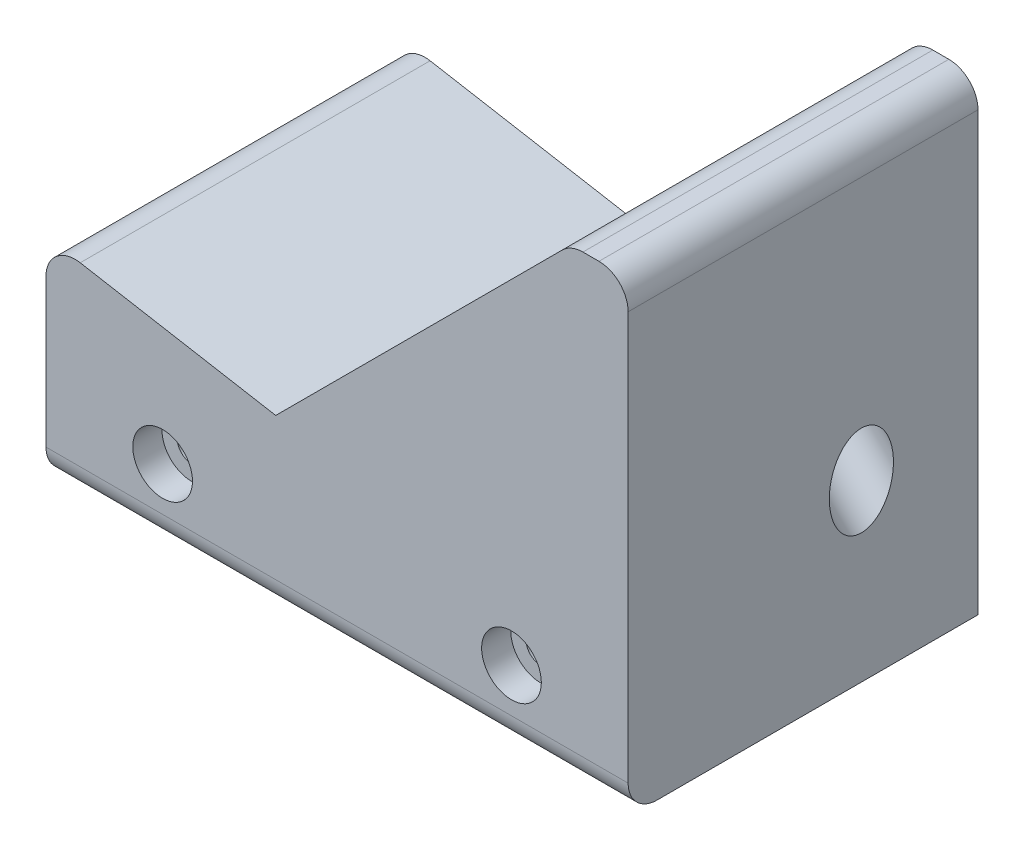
ISO-10303-21;
HEADER;
FILE_DESCRIPTION(('STEP AP214'),'2;1');
FILE_NAME('part.step','',(''),(''),'','','');
FILE_SCHEMA(('AUTOMOTIVE_DESIGN { 1 0 10303 214 1 1 1 1 }'));
ENDSEC;
DATA;
#1=APPLICATION_CONTEXT('core data for automotive mechanical design processes');
#2=APPLICATION_PROTOCOL_DEFINITION('international standard','automotive_design',2000,#1);
#3=PRODUCT_CONTEXT('',#1,'mechanical');
#4=PRODUCT('Part','Part','',(#3));
#5=PRODUCT_RELATED_PRODUCT_CATEGORY('part','',(#4));
#6=PRODUCT_DEFINITION_FORMATION('','',#4);
#7=PRODUCT_DEFINITION_CONTEXT('part definition',#1,'design');
#8=PRODUCT_DEFINITION('design','',#6,#7);
#9=PRODUCT_DEFINITION_SHAPE('','',#8);
#10=(LENGTH_UNIT() NAMED_UNIT(*) SI_UNIT(.MILLI.,.METRE.));
#11=(NAMED_UNIT(*) PLANE_ANGLE_UNIT() SI_UNIT($,.RADIAN.));
#12=(NAMED_UNIT(*) SI_UNIT($,.STERADIAN.) SOLID_ANGLE_UNIT());
#13=UNCERTAINTY_MEASURE_WITH_UNIT(LENGTH_MEASURE(1.E-05),#10,'distance_accuracy_value','');
#14=(GEOMETRIC_REPRESENTATION_CONTEXT(3) GLOBAL_UNCERTAINTY_ASSIGNED_CONTEXT((#13)) GLOBAL_UNIT_ASSIGNED_CONTEXT((#10,
#11,#12)) REPRESENTATION_CONTEXT('',''));
#15=CARTESIAN_POINT('',(0.,0.,0.));
#16=DIRECTION('',(0.,0.,1.));
#17=DIRECTION('',(1.,0.,0.));
#18=AXIS2_PLACEMENT_3D('',#15,#16,#17);
#19=CARTESIAN_POINT('',(37.874359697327,1171.575,-63.5));
#20=DIRECTION('',(0.,0.,1.));
#21=DIRECTION('',(1.,0.,0.));
#22=AXIS2_PLACEMENT_3D('',#19,#20,#21);
#23=CYLINDRICAL_SURFACE('',#22,3.17500000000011);
#24=CARTESIAN_POINT('',(37.874359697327,1171.575,-63.5));
#25=DIRECTION('',(0.,0.,1.));
#26=DIRECTION('',(1.,0.,0.));
#27=AXIS2_PLACEMENT_3D('',#24,#25,#26);
#28=CIRCLE('',#27,3.17500000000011);
#29=CARTESIAN_POINT('',(41.0493596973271,1171.575,-63.5));
#30=VERTEX_POINT('',#29);
#31=EDGE_CURVE('E176',#30,#30,#28,.T.);
#32=CARTESIAN_POINT('',(37.874359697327,1171.575,6.34999999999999));
#33=DIRECTION('',(0.,0.,1.));
#34=DIRECTION('',(1.,0.,0.));
#35=AXIS2_PLACEMENT_3D('',#32,#33,#34);
#36=CIRCLE('',#35,3.17500000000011);
#37=CARTESIAN_POINT('',(41.0493596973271,1171.575,6.34999999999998));
#38=VERTEX_POINT('',#37);
#39=EDGE_CURVE('E44',#38,#38,#36,.F.);
#40=CARTESIAN_POINT('',(41.0493596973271,1171.575,-63.5));
#41=CARTESIAN_POINT('',(41.0493596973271,1171.575,-62.7723958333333));
#42=CARTESIAN_POINT('',(41.0493596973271,1171.575,-62.0447916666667));
#43=CARTESIAN_POINT('',(41.0493596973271,1171.575,-60.5895833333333));
#44=CARTESIAN_POINT('',(41.0493596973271,1171.575,-59.8619791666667));
#45=CARTESIAN_POINT('',(41.0493596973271,1171.575,-58.4067708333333));
#46=CARTESIAN_POINT('',(41.0493596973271,1171.575,-57.6791666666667));
#47=CARTESIAN_POINT('',(41.0493596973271,1171.575,-56.2239583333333));
#48=CARTESIAN_POINT('',(41.0493596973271,1171.575,-55.4963541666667));
#49=CARTESIAN_POINT('',(41.0493596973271,1171.575,-54.0411458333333));
#50=CARTESIAN_POINT('',(41.0493596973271,1171.575,-53.3135416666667));
#51=CARTESIAN_POINT('',(41.0493596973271,1171.575,-51.8583333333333));
#52=CARTESIAN_POINT('',(41.0493596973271,1171.575,-51.1307291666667));
#53=CARTESIAN_POINT('',(41.0493596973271,1171.575,-49.6755208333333));
#54=CARTESIAN_POINT('',(41.0493596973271,1171.575,-48.9479166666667));
#55=CARTESIAN_POINT('',(41.0493596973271,1171.575,-47.4927083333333));
#56=CARTESIAN_POINT('',(41.0493596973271,1171.575,-46.7651041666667));
#57=CARTESIAN_POINT('',(41.0493596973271,1171.575,-45.3098958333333));
#58=CARTESIAN_POINT('',(41.0493596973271,1171.575,-44.5822916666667));
#59=CARTESIAN_POINT('',(41.0493596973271,1171.575,-43.1270833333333));
#60=CARTESIAN_POINT('',(41.0493596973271,1171.575,-42.3994791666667));
#61=CARTESIAN_POINT('',(41.0493596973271,1171.575,-40.9442708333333));
#62=CARTESIAN_POINT('',(41.0493596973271,1171.575,-40.2166666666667));
#63=CARTESIAN_POINT('',(41.0493596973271,1171.575,-38.7614583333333));
#64=CARTESIAN_POINT('',(41.0493596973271,1171.575,-38.0338541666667));
#65=CARTESIAN_POINT('',(41.0493596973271,1171.575,-36.5786458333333));
#66=CARTESIAN_POINT('',(41.0493596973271,1171.575,-35.8510416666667));
#67=CARTESIAN_POINT('',(41.0493596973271,1171.575,-34.3958333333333));
#68=CARTESIAN_POINT('',(41.0493596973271,1171.575,-33.6682291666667));
#69=CARTESIAN_POINT('',(41.0493596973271,1171.575,-32.2130208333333));
#70=CARTESIAN_POINT('',(41.0493596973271,1171.575,-31.4854166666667));
#71=CARTESIAN_POINT('',(41.0493596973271,1171.575,-30.0302083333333));
#72=CARTESIAN_POINT('',(41.0493596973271,1171.575,-29.3026041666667));
#73=CARTESIAN_POINT('',(41.0493596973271,1171.575,-27.8473958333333));
#74=CARTESIAN_POINT('',(41.0493596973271,1171.575,-27.1197916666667));
#75=CARTESIAN_POINT('',(41.0493596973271,1171.575,-25.6645833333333));
#76=CARTESIAN_POINT('',(41.0493596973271,1171.575,-24.9369791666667));
#77=CARTESIAN_POINT('',(41.0493596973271,1171.575,-23.4817708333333));
#78=CARTESIAN_POINT('',(41.0493596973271,1171.575,-22.7541666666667));
#79=CARTESIAN_POINT('',(41.0493596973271,1171.575,-21.2989583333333));
#80=CARTESIAN_POINT('',(41.0493596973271,1171.575,-20.5713541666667));
#81=CARTESIAN_POINT('',(41.0493596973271,1171.575,-19.1161458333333));
#82=CARTESIAN_POINT('',(41.0493596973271,1171.575,-18.3885416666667));
#83=CARTESIAN_POINT('',(41.0493596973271,1171.575,-16.9333333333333));
#84=CARTESIAN_POINT('',(41.0493596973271,1171.575,-16.2057291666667));
#85=CARTESIAN_POINT('',(41.0493596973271,1171.575,-14.7505208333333));
#86=CARTESIAN_POINT('',(41.0493596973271,1171.575,-14.0229166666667));
#87=CARTESIAN_POINT('',(41.0493596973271,1171.575,-12.5677083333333));
#88=CARTESIAN_POINT('',(41.0493596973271,1171.575,-11.8401041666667));
#89=CARTESIAN_POINT('',(41.0493596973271,1171.575,-10.3848958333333));
#90=CARTESIAN_POINT('',(41.0493596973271,1171.575,-9.65729166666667));
#91=CARTESIAN_POINT('',(41.0493596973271,1171.575,-8.20208333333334));
#92=CARTESIAN_POINT('',(41.0493596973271,1171.575,-7.47447916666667));
#93=CARTESIAN_POINT('',(41.0493596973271,1171.575,-6.01927083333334));
#94=CARTESIAN_POINT('',(41.0493596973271,1171.575,-5.29166666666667));
#95=CARTESIAN_POINT('',(41.0493596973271,1171.575,-3.83645833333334));
#96=CARTESIAN_POINT('',(41.0493596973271,1171.575,-3.10885416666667));
#97=CARTESIAN_POINT('',(41.0493596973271,1171.575,-1.65364583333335));
#98=CARTESIAN_POINT('',(41.0493596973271,1171.575,-0.926041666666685));
#99=CARTESIAN_POINT('',(41.0493596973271,1171.575,0.529166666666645));
#100=CARTESIAN_POINT('',(41.0493596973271,1171.575,1.25677083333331));
#101=CARTESIAN_POINT('',(41.0493596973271,1171.575,2.71197916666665));
#102=CARTESIAN_POINT('',(41.0493596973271,1171.575,3.43958333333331));
#103=CARTESIAN_POINT('',(41.0493596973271,1171.575,4.89479166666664));
#104=CARTESIAN_POINT('',(41.0493596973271,1171.575,5.62239583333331));
#105=CARTESIAN_POINT('',(41.0493596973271,1171.575,6.34999999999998));
#106=B_SPLINE_CURVE_WITH_KNOTS('',3,(#40,#41,#42,#43,#44,#45,#46,#47,#48,#49,#50,#51,#52,#53,
#54,#55,#56,#57,#58,#59,#60,#61,#62,#63,#64,#65,#66,#67,#68,#69,#70,#71,#72,#73,#74,#75,#76,#77,
#78,#79,#80,#81,#82,#83,#84,#85,#86,#87,#88,#89,#90,#91,#92,#93,#94,#95,#96,#97,#98,#99,#100,
#101,#102,#103,#104,#105),.UNSPECIFIED.,.F.,.F.,(4,2,2,2,2,2,2,2,2,2,2,2,2,2,2,2,2,2,2,2,2,2,2,
2,2,2,2,2,2,2,2,2,4),(0.,2.18281250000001,4.365625,6.5484375,8.73125000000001,10.9140625,
13.096875,15.2796875,17.4625,19.6453125,21.828125,24.0109375,26.19375,28.3765625,30.559375,
32.7421875,34.925,37.1078125,39.290625,41.4734375,43.65625,45.8390625,48.021875,50.2046875,
52.3875,54.5703125,56.753125,58.9359375,61.11875,63.3015625,65.484375,67.6671875,69.85),.UNSPECIFIED.);
#107=EDGE_CURVE('BSEAM40',#30,#38,#106,.T.);
#108=ORIENTED_EDGE('',*,*,#31,.F.);
#109=ORIENTED_EDGE('',*,*,#39,.F.);
#110=ORIENTED_EDGE('',*,*,#107,.T.);
#111=ORIENTED_EDGE('',*,*,#107,.F.);
#112=EDGE_LOOP('',(#108,#110,#109,#111));
#113=FACE_BOUND('',#112,.T.);
#114=ADVANCED_FACE('F40',(#113),#23,.F.);
#115=CARTESIAN_POINT('',(-38.1000000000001,1171.575,-63.5));
#116=DIRECTION('',(0.,0.,1.));
#117=DIRECTION('',(1.,0.,0.));
#118=AXIS2_PLACEMENT_3D('',#115,#116,#117);
#119=CYLINDRICAL_SURFACE('',#118,3.17500000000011);
#120=CARTESIAN_POINT('',(-38.1000000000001,1171.575,-63.5));
#121=DIRECTION('',(0.,0.,1.));
#122=DIRECTION('',(1.,0.,0.));
#123=AXIS2_PLACEMENT_3D('',#120,#121,#122);
#124=CIRCLE('',#123,3.17500000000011);
#125=CARTESIAN_POINT('',(-34.9249999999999,1171.575,-63.5));
#126=VERTEX_POINT('',#125);
#127=EDGE_CURVE('E128',#126,#126,#124,.T.);
#128=CARTESIAN_POINT('',(-38.1000000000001,1171.575,6.34999999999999));
#129=DIRECTION('',(0.,0.,1.));
#130=DIRECTION('',(1.,0.,0.));
#131=AXIS2_PLACEMENT_3D('',#128,#129,#130);
#132=CIRCLE('',#131,3.17500000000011);
#133=CARTESIAN_POINT('',(-34.9249999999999,1171.575,6.34999999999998));
#134=VERTEX_POINT('',#133);
#135=EDGE_CURVE('E170',#134,#134,#132,.F.);
#136=CARTESIAN_POINT('',(-34.9249999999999,1171.575,-63.5));
#137=CARTESIAN_POINT('',(-34.9249999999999,1171.575,-62.7723958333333));
#138=CARTESIAN_POINT('',(-34.9249999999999,1171.575,-62.0447916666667));
#139=CARTESIAN_POINT('',(-34.9249999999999,1171.575,-60.5895833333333));
#140=CARTESIAN_POINT('',(-34.9249999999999,1171.575,-59.8619791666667));
#141=CARTESIAN_POINT('',(-34.9249999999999,1171.575,-58.4067708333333));
#142=CARTESIAN_POINT('',(-34.9249999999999,1171.575,-57.6791666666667));
#143=CARTESIAN_POINT('',(-34.9249999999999,1171.575,-56.2239583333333));
#144=CARTESIAN_POINT('',(-34.9249999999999,1171.575,-55.4963541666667));
#145=CARTESIAN_POINT('',(-34.9249999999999,1171.575,-54.0411458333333));
#146=CARTESIAN_POINT('',(-34.9249999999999,1171.575,-53.3135416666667));
#147=CARTESIAN_POINT('',(-34.9249999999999,1171.575,-51.8583333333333));
#148=CARTESIAN_POINT('',(-34.9249999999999,1171.575,-51.1307291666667));
#149=CARTESIAN_POINT('',(-34.9249999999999,1171.575,-49.6755208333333));
#150=CARTESIAN_POINT('',(-34.9249999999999,1171.575,-48.9479166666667));
#151=CARTESIAN_POINT('',(-34.9249999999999,1171.575,-47.4927083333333));
#152=CARTESIAN_POINT('',(-34.9249999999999,1171.575,-46.7651041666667));
#153=CARTESIAN_POINT('',(-34.9249999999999,1171.575,-45.3098958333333));
#154=CARTESIAN_POINT('',(-34.9249999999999,1171.575,-44.5822916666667));
#155=CARTESIAN_POINT('',(-34.9249999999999,1171.575,-43.1270833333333));
#156=CARTESIAN_POINT('',(-34.9249999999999,1171.575,-42.3994791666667));
#157=CARTESIAN_POINT('',(-34.9249999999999,1171.575,-40.9442708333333));
#158=CARTESIAN_POINT('',(-34.9249999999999,1171.575,-40.2166666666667));
#159=CARTESIAN_POINT('',(-34.9249999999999,1171.575,-38.7614583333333));
#160=CARTESIAN_POINT('',(-34.9249999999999,1171.575,-38.0338541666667));
#161=CARTESIAN_POINT('',(-34.9249999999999,1171.575,-36.5786458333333));
#162=CARTESIAN_POINT('',(-34.9249999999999,1171.575,-35.8510416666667));
#163=CARTESIAN_POINT('',(-34.9249999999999,1171.575,-34.3958333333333));
#164=CARTESIAN_POINT('',(-34.9249999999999,1171.575,-33.6682291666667));
#165=CARTESIAN_POINT('',(-34.9249999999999,1171.575,-32.2130208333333));
#166=CARTESIAN_POINT('',(-34.9249999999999,1171.575,-31.4854166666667));
#167=CARTESIAN_POINT('',(-34.9249999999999,1171.575,-30.0302083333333));
#168=CARTESIAN_POINT('',(-34.9249999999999,1171.575,-29.3026041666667));
#169=CARTESIAN_POINT('',(-34.9249999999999,1171.575,-27.8473958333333));
#170=CARTESIAN_POINT('',(-34.9249999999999,1171.575,-27.1197916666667));
#171=CARTESIAN_POINT('',(-34.9249999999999,1171.575,-25.6645833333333));
#172=CARTESIAN_POINT('',(-34.9249999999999,1171.575,-24.9369791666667));
#173=CARTESIAN_POINT('',(-34.9249999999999,1171.575,-23.4817708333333));
#174=CARTESIAN_POINT('',(-34.9249999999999,1171.575,-22.7541666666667));
#175=CARTESIAN_POINT('',(-34.9249999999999,1171.575,-21.2989583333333));
#176=CARTESIAN_POINT('',(-34.9249999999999,1171.575,-20.5713541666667));
#177=CARTESIAN_POINT('',(-34.9249999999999,1171.575,-19.1161458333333));
#178=CARTESIAN_POINT('',(-34.9249999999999,1171.575,-18.3885416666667));
#179=CARTESIAN_POINT('',(-34.9249999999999,1171.575,-16.9333333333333));
#180=CARTESIAN_POINT('',(-34.9249999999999,1171.575,-16.2057291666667));
#181=CARTESIAN_POINT('',(-34.9249999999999,1171.575,-14.7505208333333));
#182=CARTESIAN_POINT('',(-34.9249999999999,1171.575,-14.0229166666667));
#183=CARTESIAN_POINT('',(-34.9249999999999,1171.575,-12.5677083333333));
#184=CARTESIAN_POINT('',(-34.9249999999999,1171.575,-11.8401041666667));
#185=CARTESIAN_POINT('',(-34.9249999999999,1171.575,-10.3848958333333));
#186=CARTESIAN_POINT('',(-34.9249999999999,1171.575,-9.65729166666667));
#187=CARTESIAN_POINT('',(-34.9249999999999,1171.575,-8.20208333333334));
#188=CARTESIAN_POINT('',(-34.9249999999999,1171.575,-7.47447916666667));
#189=CARTESIAN_POINT('',(-34.9249999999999,1171.575,-6.01927083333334));
#190=CARTESIAN_POINT('',(-34.9249999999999,1171.575,-5.29166666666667));
#191=CARTESIAN_POINT('',(-34.9249999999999,1171.575,-3.83645833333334));
#192=CARTESIAN_POINT('',(-34.9249999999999,1171.575,-3.10885416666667));
#193=CARTESIAN_POINT('',(-34.9249999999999,1171.575,-1.65364583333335));
#194=CARTESIAN_POINT('',(-34.9249999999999,1171.575,-0.926041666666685));
#195=CARTESIAN_POINT('',(-34.9249999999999,1171.575,0.529166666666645));
#196=CARTESIAN_POINT('',(-34.9249999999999,1171.575,1.25677083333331));
#197=CARTESIAN_POINT('',(-34.9249999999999,1171.575,2.71197916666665));
#198=CARTESIAN_POINT('',(-34.9249999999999,1171.575,3.43958333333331));
#199=CARTESIAN_POINT('',(-34.9249999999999,1171.575,4.89479166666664));
#200=CARTESIAN_POINT('',(-34.9249999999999,1171.575,5.62239583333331));
#201=CARTESIAN_POINT('',(-34.9249999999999,1171.575,6.34999999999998));
#202=B_SPLINE_CURVE_WITH_KNOTS('',3,(#136,#137,#138,#139,#140,#141,#142,#143,#144,#145,#146,
#147,#148,#149,#150,#151,#152,#153,#154,#155,#156,#157,#158,#159,#160,#161,#162,#163,#164,#165,
#166,#167,#168,#169,#170,#171,#172,#173,#174,#175,#176,#177,#178,#179,#180,#181,#182,#183,#184,
#185,#186,#187,#188,#189,#190,#191,#192,#193,#194,#195,#196,#197,#198,#199,#200,#201),
.UNSPECIFIED.,.F.,.F.,(4,2,2,2,2,2,2,2,2,2,2,2,2,2,2,2,2,2,2,2,2,2,2,2,2,2,2,2,2,2,2,2,4),(0.,
2.18281250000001,4.365625,6.5484375,8.73125000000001,10.9140625,13.096875,15.2796875,17.4625,
19.6453125,21.828125,24.0109375,26.19375,28.3765625,30.559375,32.7421875,34.925,37.1078125,
39.290625,41.4734375,43.65625,45.8390625,48.021875,50.2046875,52.3875,54.5703125,56.753125,
58.9359375,61.11875,63.3015625,65.484375,67.6671875,69.85),.UNSPECIFIED.);
#203=EDGE_CURVE('BSEAM266',#126,#134,#202,.T.);
#204=ORIENTED_EDGE('',*,*,#127,.F.);
#205=ORIENTED_EDGE('',*,*,#135,.F.);
#206=ORIENTED_EDGE('',*,*,#203,.T.);
#207=ORIENTED_EDGE('',*,*,#203,.F.);
#208=EDGE_LOOP('',(#204,#206,#205,#207));
#209=FACE_BOUND('',#208,.T.);
#210=ADVANCED_FACE('F266',(#209),#119,.F.);
#211=CARTESIAN_POINT('',(-63.5,1155.7,12.7));
#212=DIRECTION('',(-1.,0.,0.));
#213=DIRECTION('',(0.,-1.,0.));
#214=AXIS2_PLACEMENT_3D('',#211,#212,#213);
#215=PLANE('',#214);
#216=DIRECTION('',(0.,0.,-1.));
#217=VECTOR('',#216,1.);
#218=CARTESIAN_POINT('',(-63.5000000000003,1194.28192596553,12.7));
#219=LINE('',#218,#217);
#220=CARTESIAN_POINT('',(-63.5000000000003,1194.28192596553,12.7));
#221=VERTEX_POINT('',#220);
#222=CARTESIAN_POINT('',(-63.5000000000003,1194.28192596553,-63.5));
#223=VERTEX_POINT('',#222);
#224=EDGE_CURVE('E166',#221,#223,#219,.T.);
#225=ORIENTED_EDGE('',*,*,#224,.T.);
#226=DIRECTION('',(0.,1.,0.));
#227=VECTOR('',#226,1.);
#228=CARTESIAN_POINT('',(-63.5,1155.7,-63.5));
#229=LINE('',#228,#227);
#230=CARTESIAN_POINT('',(-63.5,1155.7,-63.5));
#231=VERTEX_POINT('',#230);
#232=EDGE_CURVE('E57',#231,#223,#229,.T.);
#233=ORIENTED_EDGE('',*,*,#232,.F.);
#234=DIRECTION('',(0.,0.,-1.));
#235=VECTOR('',#234,1.);
#236=CARTESIAN_POINT('',(-63.5,1155.7,12.7));
#237=LINE('',#236,#235);
#238=CARTESIAN_POINT('',(-63.5,1155.7,6.35));
#239=VERTEX_POINT('',#238);
#240=EDGE_CURVE('E143',#239,#231,#237,.T.);
#241=ORIENTED_EDGE('',*,*,#240,.F.);
#242=CARTESIAN_POINT('',(-63.5000000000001,1162.05,6.35));
#243=DIRECTION('',(-1.,0.,0.));
#244=DIRECTION('',(0.,-1.,0.));
#245=AXIS2_PLACEMENT_3D('',#242,#243,#244);
#246=CIRCLE('',#245,6.35);
#247=CARTESIAN_POINT('',(-63.5000000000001,1162.05,12.7));
#248=VERTEX_POINT('',#247);
#249=EDGE_CURVE('E65',#239,#248,#246,.T.);
#250=ORIENTED_EDGE('',*,*,#249,.T.);
#251=DIRECTION('',(0.,1.,0.));
#252=VECTOR('',#251,1.);
#253=CARTESIAN_POINT('',(-63.5,1155.7,12.7));
#254=LINE('',#253,#252);
#255=EDGE_CURVE('E212',#248,#221,#254,.T.);
#256=ORIENTED_EDGE('',*,*,#255,.T.);
#257=EDGE_LOOP('',(#225,#233,#241,#250,#256));
#258=FACE_BOUND('',#257,.T.);
#259=ADVANCED_FACE('F255',(#258),#215,.T.);
#260=CARTESIAN_POINT('',(63.274359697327,1155.7,12.7));
#261=DIRECTION('',(0.,-1.,0.));
#262=DIRECTION('',(0.,0.,-1.));
#263=AXIS2_PLACEMENT_3D('',#260,#261,#262);
#264=PLANE('',#263);
#265=ORIENTED_EDGE('',*,*,#240,.T.);
#266=DIRECTION('',(-1.,0.,0.));
#267=VECTOR('',#266,1.);
#268=CARTESIAN_POINT('',(63.274359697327,1155.7,-63.5));
#269=LINE('',#268,#267);
#270=CARTESIAN_POINT('',(63.274359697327,1155.7,-63.5));
#271=VERTEX_POINT('',#270);
#272=EDGE_CURVE('E198',#271,#231,#269,.T.);
#273=ORIENTED_EDGE('',*,*,#272,.F.);
#274=DIRECTION('',(0.,0.,-1.));
#275=VECTOR('',#274,1.);
#276=CARTESIAN_POINT('',(63.274359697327,1155.7,12.7));
#277=LINE('',#276,#275);
#278=CARTESIAN_POINT('',(63.274359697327,1155.7,6.35));
#279=VERTEX_POINT('',#278);
#280=EDGE_CURVE('E148',#279,#271,#277,.T.);
#281=ORIENTED_EDGE('',*,*,#280,.F.);
#282=DIRECTION('',(-1.,0.,0.));
#283=VECTOR('',#282,1.);
#284=CARTESIAN_POINT('',(-63.5,1155.7,6.35));
#285=LINE('',#284,#283);
#286=EDGE_CURVE('E164',#279,#239,#285,.T.);
#287=ORIENTED_EDGE('',*,*,#286,.T.);
#288=EDGE_LOOP('',(#265,#273,#281,#287));
#289=FACE_BOUND('',#288,.T.);
#290=ADVANCED_FACE('F252',(#289),#264,.T.);
#291=CARTESIAN_POINT('',(63.274359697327,1155.7,12.7));
#292=DIRECTION('',(-1.,0.,0.));
#293=DIRECTION('',(0.,0.,1.));
#294=AXIS2_PLACEMENT_3D('',#291,#292,#293);
#295=PLANE('',#294);
#296=CARTESIAN_POINT('',(63.274359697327,1193.73502100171,-38.1));
#297=DIRECTION('',(-1.,0.,0.));
#298=DIRECTION('',(0.,1.,0.));
#299=AXIS2_PLACEMENT_3D('',#296,#297,#298);
#300=ELLIPSE('',#299,9.87828173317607,6.985);
#301=CARTESIAN_POINT('',(63.274359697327,1203.61330273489,-38.1));
#302=VERTEX_POINT('',#301);
#303=EDGE_CURVE('E209',#302,#302,#300,.T.);
#304=ORIENTED_EDGE('',*,*,#303,.T.);
#305=EDGE_LOOP('',(#304));
#306=FACE_BOUND('',#305,.T.);
#307=DIRECTION('',(0.,-1.,0.));
#308=VECTOR('',#307,1.);
#309=CARTESIAN_POINT('',(63.274359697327,1250.95,-63.5));
#310=LINE('',#309,#308);
#311=CARTESIAN_POINT('',(63.2743596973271,1250.95,-63.5));
#312=VERTEX_POINT('',#311);
#313=EDGE_CURVE('E196',#312,#271,#310,.T.);
#314=ORIENTED_EDGE('',*,*,#313,.F.);
#315=DIRECTION('',(0.,0.,-1.));
#316=VECTOR('',#315,1.);
#317=CARTESIAN_POINT('',(63.274359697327,1250.95,12.7));
#318=LINE('',#317,#316);
#319=CARTESIAN_POINT('',(63.274359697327,1250.95,12.7));
#320=VERTEX_POINT('',#319);
#321=EDGE_CURVE('E155',#312,#320,#318,.F.);
#322=ORIENTED_EDGE('',*,*,#321,.T.);
#323=DIRECTION('',(0.,1.,0.));
#324=VECTOR('',#323,1.);
#325=CARTESIAN_POINT('',(63.274359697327,1155.7,12.7));
#326=LINE('',#325,#324);
#327=CARTESIAN_POINT('',(63.274359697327,1162.05,12.7));
#328=VERTEX_POINT('',#327);
#329=EDGE_CURVE('E222',#328,#320,#326,.T.);
#330=ORIENTED_EDGE('',*,*,#329,.F.);
#331=CARTESIAN_POINT('',(63.274359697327,1162.05,6.35));
#332=DIRECTION('',(-1.,0.,0.));
#333=DIRECTION('',(0.,0.,1.));
#334=AXIS2_PLACEMENT_3D('',#331,#332,#333);
#335=CIRCLE('',#334,6.35);
#336=EDGE_CURVE('E145',#328,#279,#335,.F.);
#337=ORIENTED_EDGE('',*,*,#336,.T.);
#338=ORIENTED_EDGE('',*,*,#280,.T.);
#339=EDGE_LOOP('',(#314,#322,#330,#337,#338));
#340=FACE_BOUND('',#339,.T.);
#341=ADVANCED_FACE('F246',(#306,#340),#295,.F.);
#342=CARTESIAN_POINT('',(50.8,1257.3,12.7));
#343=DIRECTION('',(0.,1.,0.));
#344=DIRECTION('',(0.,0.,1.));
#345=AXIS2_PLACEMENT_3D('',#342,#343,#344);
#346=PLANE('',#345);
#347=DIRECTION('',(0.,0.,-1.));
#348=VECTOR('',#347,1.);
#349=CARTESIAN_POINT('',(56.924359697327,1257.3,-76.2));
#350=LINE('',#349,#348);
#351=CARTESIAN_POINT('',(56.924359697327,1257.3,12.7));
#352=VERTEX_POINT('',#351);
#353=CARTESIAN_POINT('',(56.924359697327,1257.3,-63.5));
#354=VERTEX_POINT('',#353);
#355=EDGE_CURVE('E137',#352,#354,#350,.T.);
#356=ORIENTED_EDGE('',*,*,#355,.T.);
#357=DIRECTION('',(1.,0.,0.));
#358=VECTOR('',#357,1.);
#359=CARTESIAN_POINT('',(53.430256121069,1257.3,-63.5));
#360=LINE('',#359,#358);
#361=CARTESIAN_POINT('',(53.430256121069,1257.3,-63.5));
#362=VERTEX_POINT('',#361);
#363=EDGE_CURVE('E120',#362,#354,#360,.T.);
#364=ORIENTED_EDGE('',*,*,#363,.F.);
#365=DIRECTION('',(0.,0.,-1.));
#366=VECTOR('',#365,1.);
#367=CARTESIAN_POINT('',(53.430256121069,1257.3,12.7));
#368=LINE('',#367,#366);
#369=CARTESIAN_POINT('',(53.430256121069,1257.3,12.7));
#370=VERTEX_POINT('',#369);
#371=EDGE_CURVE('E134',#362,#370,#368,.F.);
#372=ORIENTED_EDGE('',*,*,#371,.T.);
#373=DIRECTION('',(1.,0.,0.));
#374=VECTOR('',#373,1.);
#375=CARTESIAN_POINT('',(50.8,1257.3,12.7));
#376=LINE('',#375,#374);
#377=EDGE_CURVE('E220',#370,#352,#376,.T.);
#378=ORIENTED_EDGE('',*,*,#377,.T.);
#379=EDGE_LOOP('',(#356,#364,#372,#378));
#380=FACE_BOUND('',#379,.T.);
#381=ADVANCED_FACE('F132',(#380),#346,.T.);
#382=CARTESIAN_POINT('',(-13.4717661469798,1193.02823385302,12.7));
#383=DIRECTION('',(-0.707106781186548,0.707106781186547,0.));
#384=DIRECTION('',(-0.707106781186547,-0.707106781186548,0.));
#385=AXIS2_PLACEMENT_3D('',#382,#383,#384);
#386=PLANE('',#385);
#387=CARTESIAN_POINT('',(25.2546903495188,1231.75469034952,-38.1));
#388=DIRECTION('',(-0.707106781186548,0.707106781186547,0.));
#389=DIRECTION('',(-0.707106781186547,-0.707106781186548,0.));
#390=AXIS2_PLACEMENT_3D('',#387,#388,#389);
#391=CIRCLE('',#390,6.985);
#392=CARTESIAN_POINT('',(20.3155494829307,1226.81554948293,-38.1));
#393=VERTEX_POINT('',#392);
#394=EDGE_CURVE('E206',#393,#393,#391,.T.);
#395=ORIENTED_EDGE('',*,*,#394,.F.);
#396=EDGE_LOOP('',(#395));
#397=FACE_BOUND('',#396,.T.);
#398=DIRECTION('',(0.,0.,-1.));
#399=VECTOR('',#398,1.);
#400=CARTESIAN_POINT('',(48.9401280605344,1255.44012806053,12.7));
#401=LINE('',#400,#399);
#402=CARTESIAN_POINT('',(48.9401280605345,1255.44012806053,12.7));
#403=VERTEX_POINT('',#402);
#404=CARTESIAN_POINT('',(48.9401280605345,1255.44012806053,-63.5));
#405=VERTEX_POINT('',#404);
#406=EDGE_CURVE('E49',#403,#405,#401,.T.);
#407=ORIENTED_EDGE('',*,*,#406,.T.);
#408=DIRECTION('',(0.707106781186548,0.707106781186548,0.));
#409=VECTOR('',#408,1.);
#410=CARTESIAN_POINT('',(-13.4717661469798,1193.02823385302,-63.5));
#411=LINE('',#410,#409);
#412=CARTESIAN_POINT('',(-13.4717661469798,1193.02823385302,-63.5));
#413=VERTEX_POINT('',#412);
#414=EDGE_CURVE('E123',#413,#405,#411,.T.);
#415=ORIENTED_EDGE('',*,*,#414,.F.);
#416=DIRECTION('',(0.,0.,-1.));
#417=VECTOR('',#416,1.);
#418=CARTESIAN_POINT('',(-13.4717661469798,1193.02823385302,12.7));
#419=LINE('',#418,#417);
#420=CARTESIAN_POINT('',(-13.4717661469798,1193.02823385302,12.7));
#421=VERTEX_POINT('',#420);
#422=EDGE_CURVE('E151',#421,#413,#419,.T.);
#423=ORIENTED_EDGE('',*,*,#422,.F.);
#424=DIRECTION('',(0.707106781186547,0.707106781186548,0.));
#425=VECTOR('',#424,1.);
#426=CARTESIAN_POINT('',(-13.4717661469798,1193.02823385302,12.7));
#427=LINE('',#426,#425);
#428=EDGE_CURVE('E217',#421,#403,#427,.T.);
#429=ORIENTED_EDGE('',*,*,#428,.T.);
#430=EDGE_LOOP('',(#407,#415,#423,#429));
#431=FACE_BOUND('',#430,.T.);
#432=ADVANCED_FACE('F237',(#397,#431),#386,.T.);
#433=CARTESIAN_POINT('',(-63.5000000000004,1201.8495612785,12.7));
#434=DIRECTION('',(0.173648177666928,0.984807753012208,0.));
#435=DIRECTION('',(-0.984807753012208,0.173648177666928,0.));
#436=AXIS2_PLACEMENT_3D('',#433,#434,#435);
#437=PLANE('',#436);
#438=ORIENTED_EDGE('',*,*,#422,.T.);
#439=DIRECTION('',(0.984807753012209,-0.173648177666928,0.));
#440=VECTOR('',#439,1.);
#441=CARTESIAN_POINT('',(-56.0473340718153,1200.53545519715,-63.5));
#442=LINE('',#441,#440);
#443=CARTESIAN_POINT('',(-56.0473340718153,1200.53545519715,-63.5));
#444=VERTEX_POINT('',#443);
#445=EDGE_CURVE('E203',#444,#413,#442,.T.);
#446=ORIENTED_EDGE('',*,*,#445,.F.);
#447=DIRECTION('',(0.,0.,-1.));
#448=VECTOR('',#447,1.);
#449=CARTESIAN_POINT('',(-56.0473340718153,1200.53545519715,12.7));
#450=LINE('',#449,#448);
#451=CARTESIAN_POINT('',(-56.0473340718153,1200.53545519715,12.7));
#452=VERTEX_POINT('',#451);
#453=EDGE_CURVE('E11',#444,#452,#450,.F.);
#454=ORIENTED_EDGE('',*,*,#453,.T.);
#455=DIRECTION('',(0.984807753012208,-0.173648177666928,0.));
#456=VECTOR('',#455,1.);
#457=CARTESIAN_POINT('',(-63.5000000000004,1201.8495612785,12.7));
#458=LINE('',#457,#456);
#459=EDGE_CURVE('E215',#452,#421,#458,.T.);
#460=ORIENTED_EDGE('',*,*,#459,.T.);
#461=EDGE_LOOP('',(#438,#446,#454,#460));
#462=FACE_BOUND('',#461,.T.);
#463=ADVANCED_FACE('F232',(#462),#437,.T.);
#464=CARTESIAN_POINT('',(56.924359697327,1250.95,12.7));
#465=DIRECTION('',(0.,0.,1.));
#466=DIRECTION('',(1.,0.,0.));
#467=AXIS2_PLACEMENT_3D('',#464,#465,#466);
#468=CYLINDRICAL_SURFACE('',#467,6.35);
#469=ORIENTED_EDGE('',*,*,#321,.F.);
#470=CARTESIAN_POINT('',(56.924359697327,1250.95,-63.5));
#471=DIRECTION('',(0.,0.,-1.));
#472=DIRECTION('',(-1.,0.,0.));
#473=AXIS2_PLACEMENT_3D('',#470,#471,#472);
#474=CIRCLE('',#473,6.35000000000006);
#475=EDGE_CURVE('E138',#354,#312,#474,.T.);
#476=ORIENTED_EDGE('',*,*,#475,.F.);
#477=ORIENTED_EDGE('',*,*,#355,.F.);
#478=CARTESIAN_POINT('',(56.924359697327,1250.95,12.7));
#479=DIRECTION('',(0.,0.,-1.));
#480=DIRECTION('',(-1.,0.,0.));
#481=AXIS2_PLACEMENT_3D('',#478,#479,#480);
#482=CIRCLE('',#481,6.35);
#483=EDGE_CURVE('E162',#320,#352,#482,.F.);
#484=ORIENTED_EDGE('',*,*,#483,.F.);
#485=EDGE_LOOP('',(#469,#476,#477,#484));
#486=FACE_BOUND('',#485,.T.);
#487=ADVANCED_FACE('F244',(#486),#468,.T.);
#488=CARTESIAN_POINT('',(53.430256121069,1250.95,12.7));
#489=DIRECTION('',(0.,0.,-1.));
#490=DIRECTION('',(-1.,0.,0.));
#491=AXIS2_PLACEMENT_3D('',#488,#489,#490);
#492=CYLINDRICAL_SURFACE('',#491,6.35);
#493=ORIENTED_EDGE('',*,*,#371,.F.);
#494=CARTESIAN_POINT('',(53.430256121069,1250.95,-63.5));
#495=DIRECTION('',(0.,0.,-1.));
#496=DIRECTION('',(-1.,0.,0.));
#497=AXIS2_PLACEMENT_3D('',#494,#495,#496);
#498=CIRCLE('',#497,6.35);
#499=EDGE_CURVE('E117',#405,#362,#498,.T.);
#500=ORIENTED_EDGE('',*,*,#499,.F.);
#501=ORIENTED_EDGE('',*,*,#406,.F.);
#502=CARTESIAN_POINT('',(53.430256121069,1250.95,12.7));
#503=DIRECTION('',(0.,0.,-1.));
#504=DIRECTION('',(-1.,0.,0.));
#505=AXIS2_PLACEMENT_3D('',#502,#503,#504);
#506=CIRCLE('',#505,6.35);
#507=EDGE_CURVE('E142',#370,#403,#506,.F.);
#508=ORIENTED_EDGE('',*,*,#507,.F.);
#509=EDGE_LOOP('',(#493,#500,#501,#508));
#510=FACE_BOUND('',#509,.T.);
#511=ADVANCED_FACE('F141',(#510),#492,.T.);
#512=CARTESIAN_POINT('',(-57.1500000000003,1194.28192596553,12.7));
#513=DIRECTION('',(0.,0.,-1.));
#514=DIRECTION('',(-1.,0.,0.));
#515=AXIS2_PLACEMENT_3D('',#512,#513,#514);
#516=CYLINDRICAL_SURFACE('',#515,6.35);
#517=ORIENTED_EDGE('',*,*,#453,.F.);
#518=CARTESIAN_POINT('',(-57.1500000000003,1194.28192596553,-63.5));
#519=DIRECTION('',(0.,0.,-1.));
#520=DIRECTION('',(-1.,0.,0.));
#521=AXIS2_PLACEMENT_3D('',#518,#519,#520);
#522=CIRCLE('',#521,6.34999999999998);
#523=EDGE_CURVE('E201',#223,#444,#522,.T.);
#524=ORIENTED_EDGE('',*,*,#523,.F.);
#525=ORIENTED_EDGE('',*,*,#224,.F.);
#526=CARTESIAN_POINT('',(-57.1500000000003,1194.28192596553,12.7));
#527=DIRECTION('',(0.,0.,-1.));
#528=DIRECTION('',(-1.,0.,0.));
#529=AXIS2_PLACEMENT_3D('',#526,#527,#528);
#530=CIRCLE('',#529,6.35);
#531=EDGE_CURVE('E157',#452,#221,#530,.F.);
#532=ORIENTED_EDGE('',*,*,#531,.F.);
#533=EDGE_LOOP('',(#517,#524,#525,#532));
#534=FACE_BOUND('',#533,.T.);
#535=ADVANCED_FACE('F42',(#534),#516,.T.);
#536=CARTESIAN_POINT('',(0.,0.,12.7));
#537=DIRECTION('',(0.,0.,-1.));
#538=DIRECTION('',(-1.,0.,0.));
#539=AXIS2_PLACEMENT_3D('',#536,#537,#538);
#540=PLANE('',#539);
#541=CARTESIAN_POINT('',(37.874359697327,1171.575,12.7));
#542=DIRECTION('',(0.,0.,1.));
#543=DIRECTION('',(1.,0.,0.));
#544=AXIS2_PLACEMENT_3D('',#541,#542,#543);
#545=CIRCLE('',#544,6.49985999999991);
#546=CARTESIAN_POINT('',(44.3742196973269,1171.575,12.7));
#547=VERTEX_POINT('',#546);
#548=EDGE_CURVE('E178',#547,#547,#545,.T.);
#549=ORIENTED_EDGE('',*,*,#548,.F.);
#550=EDGE_LOOP('',(#549));
#551=FACE_BOUND('',#550,.T.);
#552=CARTESIAN_POINT('',(-38.1000000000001,1171.575,12.7));
#553=DIRECTION('',(0.,0.,1.));
#554=DIRECTION('',(1.,0.,0.));
#555=AXIS2_PLACEMENT_3D('',#552,#553,#554);
#556=CIRCLE('',#555,6.49985999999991);
#557=CARTESIAN_POINT('',(-31.6001400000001,1171.575,12.7));
#558=VERTEX_POINT('',#557);
#559=EDGE_CURVE('E188',#558,#558,#556,.T.);
#560=ORIENTED_EDGE('',*,*,#559,.F.);
#561=EDGE_LOOP('',(#560));
#562=FACE_BOUND('',#561,.T.);
#563=ORIENTED_EDGE('',*,*,#329,.T.);
#564=ORIENTED_EDGE('',*,*,#483,.T.);
#565=ORIENTED_EDGE('',*,*,#377,.F.);
#566=ORIENTED_EDGE('',*,*,#507,.T.);
#567=ORIENTED_EDGE('',*,*,#428,.F.);
#568=ORIENTED_EDGE('',*,*,#459,.F.);
#569=ORIENTED_EDGE('',*,*,#531,.T.);
#570=ORIENTED_EDGE('',*,*,#255,.F.);
#571=DIRECTION('',(-1.,0.,0.));
#572=VECTOR('',#571,1.);
#573=CARTESIAN_POINT('',(63.274359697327,1162.05,12.7));
#574=LINE('',#573,#572);
#575=EDGE_CURVE('E160',#248,#328,#574,.F.);
#576=ORIENTED_EDGE('',*,*,#575,.T.);
#577=EDGE_LOOP('',(#563,#564,#565,#566,#567,#568,#569,#570,#576));
#578=FACE_BOUND('',#577,.T.);
#579=ADVANCED_FACE('F239',(#551,#562,#578),#540,.F.);
#580=CARTESIAN_POINT('',(63.274359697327,1162.05,6.35));
#581=DIRECTION('',(1.,0.,0.));
#582=DIRECTION('',(0.,0.,-1.));
#583=AXIS2_PLACEMENT_3D('',#580,#581,#582);
#584=CYLINDRICAL_SURFACE('',#583,6.35);
#585=ORIENTED_EDGE('',*,*,#336,.F.);
#586=ORIENTED_EDGE('',*,*,#575,.F.);
#587=ORIENTED_EDGE('',*,*,#249,.F.);
#588=ORIENTED_EDGE('',*,*,#286,.F.);
#589=EDGE_LOOP('',(#585,#586,#587,#588));
#590=FACE_BOUND('',#589,.T.);
#591=ADVANCED_FACE('F250',(#590),#584,.T.);
#592=CARTESIAN_POINT('',(82.2918701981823,1174.71751050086,-38.1));
#593=DIRECTION('',(-0.707106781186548,0.707106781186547,0.));
#594=DIRECTION('',(-0.707106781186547,-0.707106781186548,0.));
#595=AXIS2_PLACEMENT_3D('',#592,#593,#594);
#596=CYLINDRICAL_SURFACE('',#595,6.985);
#597=ORIENTED_EDGE('',*,*,#394,.T.);
#598=EDGE_LOOP('',(#597));
#599=FACE_BOUND('',#598,.T.);
#600=ORIENTED_EDGE('',*,*,#303,.F.);
#601=EDGE_LOOP('',(#600));
#602=FACE_BOUND('',#601,.T.);
#603=ADVANCED_FACE('F281',(#599,#602),#596,.F.);
#604=CARTESIAN_POINT('',(53.430256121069,1250.95,-63.5));
#605=DIRECTION('',(0.,0.,-1.));
#606=DIRECTION('',(-1.,0.,0.));
#607=AXIS2_PLACEMENT_3D('',#604,#605,#606);
#608=PLANE('',#607);
#609=ORIENTED_EDGE('',*,*,#127,.T.);
#610=EDGE_LOOP('',(#609));
#611=FACE_BOUND('',#610,.T.);
#612=ORIENTED_EDGE('',*,*,#31,.T.);
#613=EDGE_LOOP('',(#612));
#614=FACE_BOUND('',#613,.T.);
#615=ORIENTED_EDGE('',*,*,#499,.T.);
#616=ORIENTED_EDGE('',*,*,#363,.T.);
#617=ORIENTED_EDGE('',*,*,#475,.T.);
#618=ORIENTED_EDGE('',*,*,#313,.T.);
#619=ORIENTED_EDGE('',*,*,#272,.T.);
#620=ORIENTED_EDGE('',*,*,#232,.T.);
#621=ORIENTED_EDGE('',*,*,#523,.T.);
#622=ORIENTED_EDGE('',*,*,#445,.T.);
#623=ORIENTED_EDGE('',*,*,#414,.T.);
#624=EDGE_LOOP('',(#615,#616,#617,#618,#619,#620,#621,#622,#623));
#625=FACE_BOUND('',#624,.T.);
#626=ADVANCED_FACE('F119',(#611,#614,#625),#608,.T.);
#627=CARTESIAN_POINT('',(-38.1000000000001,1171.575,6.35));
#628=DIRECTION('',(0.,0.,1.));
#629=DIRECTION('',(1.,0.,0.));
#630=AXIS2_PLACEMENT_3D('',#627,#628,#629);
#631=PLANE('',#630);
#632=CARTESIAN_POINT('',(-38.1000000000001,1171.575,6.35));
#633=DIRECTION('',(0.,0.,1.));
#634=DIRECTION('',(1.,0.,0.));
#635=AXIS2_PLACEMENT_3D('',#632,#633,#634);
#636=CIRCLE('',#635,6.49985999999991);
#637=CARTESIAN_POINT('',(-31.6001400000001,1171.575,6.35));
#638=VERTEX_POINT('',#637);
#639=EDGE_CURVE('E183',#638,#638,#636,.T.);
#640=ORIENTED_EDGE('',*,*,#639,.T.);
#641=EDGE_LOOP('',(#640));
#642=FACE_BOUND('',#641,.T.);
#643=ORIENTED_EDGE('',*,*,#135,.T.);
#644=EDGE_LOOP('',(#643));
#645=FACE_BOUND('',#644,.T.);
#646=ADVANCED_FACE('F280',(#642,#645),#631,.T.);
#647=CARTESIAN_POINT('',(-38.1000000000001,1171.575,6.35));
#648=DIRECTION('',(0.,0.,1.));
#649=DIRECTION('',(1.,0.,0.));
#650=AXIS2_PLACEMENT_3D('',#647,#648,#649);
#651=CYLINDRICAL_SURFACE('',#650,6.49985999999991);
#652=ORIENTED_EDGE('',*,*,#639,.F.);
#653=EDGE_LOOP('',(#652));
#654=FACE_BOUND('',#653,.T.);
#655=ORIENTED_EDGE('',*,*,#559,.T.);
#656=EDGE_LOOP('',(#655));
#657=FACE_BOUND('',#656,.T.);
#658=ADVANCED_FACE('F322',(#654,#657),#651,.F.);
#659=CARTESIAN_POINT('',(37.874359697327,1171.575,6.35));
#660=DIRECTION('',(0.,0.,1.));
#661=DIRECTION('',(1.,0.,0.));
#662=AXIS2_PLACEMENT_3D('',#659,#660,#661);
#663=PLANE('',#662);
#664=CARTESIAN_POINT('',(37.874359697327,1171.575,6.35));
#665=DIRECTION('',(0.,0.,1.));
#666=DIRECTION('',(1.,0.,0.));
#667=AXIS2_PLACEMENT_3D('',#664,#665,#666);
#668=CIRCLE('',#667,6.49985999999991);
#669=CARTESIAN_POINT('',(44.3742196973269,1171.575,6.35));
#670=VERTEX_POINT('',#669);
#671=EDGE_CURVE('E172',#670,#670,#668,.T.);
#672=ORIENTED_EDGE('',*,*,#671,.T.);
#673=EDGE_LOOP('',(#672));
#674=FACE_BOUND('',#673,.T.);
#675=ORIENTED_EDGE('',*,*,#39,.T.);
#676=EDGE_LOOP('',(#675));
#677=FACE_BOUND('',#676,.T.);
#678=ADVANCED_FACE('F330',(#674,#677),#663,.T.);
#679=CARTESIAN_POINT('',(37.874359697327,1171.575,6.35));
#680=DIRECTION('',(0.,0.,1.));
#681=DIRECTION('',(1.,0.,0.));
#682=AXIS2_PLACEMENT_3D('',#679,#680,#681);
#683=CYLINDRICAL_SURFACE('',#682,6.49985999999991);
#684=ORIENTED_EDGE('',*,*,#671,.F.);
#685=EDGE_LOOP('',(#684));
#686=FACE_BOUND('',#685,.T.);
#687=ORIENTED_EDGE('',*,*,#548,.T.);
#688=EDGE_LOOP('',(#687));
#689=FACE_BOUND('',#688,.T.);
#690=ADVANCED_FACE('F337',(#686,#689),#683,.F.);
#691=CLOSED_SHELL('',(#114,#210,#259,#290,#341,#381,#432,#463,#487,#511,#535,#579,#591,#603,
#626,#646,#658,#678,#690));
#692=MANIFOLD_SOLID_BREP('B2',#691);
#693=ADVANCED_BREP_SHAPE_REPRESENTATION('',(#18,#692),#14);
#694=SHAPE_DEFINITION_REPRESENTATION(#9,#693);
ENDSEC;
END-ISO-10303-21;
